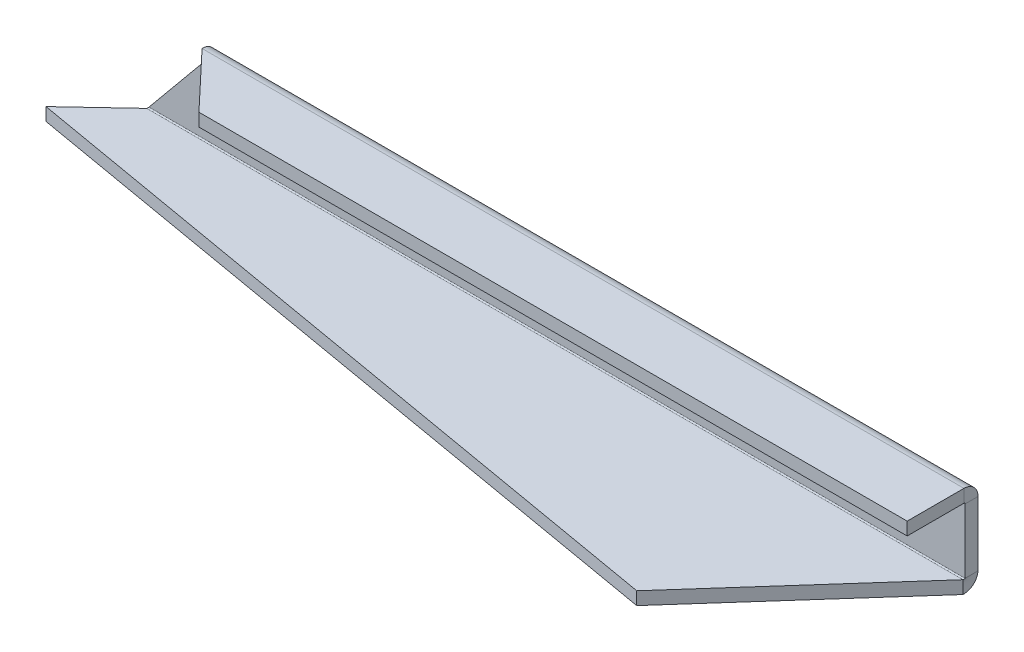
ISO-10303-21;
HEADER;
FILE_DESCRIPTION(('STEP AP214'),'2;1');
FILE_NAME('part.step','',(''),(''),'','','');
FILE_SCHEMA(('AUTOMOTIVE_DESIGN { 1 0 10303 214 1 1 1 1 }'));
ENDSEC;
DATA;
#1=APPLICATION_CONTEXT('core data for automotive mechanical design processes');
#2=APPLICATION_PROTOCOL_DEFINITION('international standard','automotive_design',2000,#1);
#3=PRODUCT_CONTEXT('',#1,'mechanical');
#4=PRODUCT('Part','Part','',(#3));
#5=PRODUCT_RELATED_PRODUCT_CATEGORY('part','',(#4));
#6=PRODUCT_DEFINITION_FORMATION('','',#4);
#7=PRODUCT_DEFINITION_CONTEXT('part definition',#1,'design');
#8=PRODUCT_DEFINITION('design','',#6,#7);
#9=PRODUCT_DEFINITION_SHAPE('','',#8);
#10=(LENGTH_UNIT() NAMED_UNIT(*) SI_UNIT(.MILLI.,.METRE.));
#11=(NAMED_UNIT(*) PLANE_ANGLE_UNIT() SI_UNIT($,.RADIAN.));
#12=(NAMED_UNIT(*) SI_UNIT($,.STERADIAN.) SOLID_ANGLE_UNIT());
#13=UNCERTAINTY_MEASURE_WITH_UNIT(LENGTH_MEASURE(1.E-05),#10,'distance_accuracy_value','');
#14=(GEOMETRIC_REPRESENTATION_CONTEXT(3) GLOBAL_UNCERTAINTY_ASSIGNED_CONTEXT((#13)) GLOBAL_UNIT_ASSIGNED_CONTEXT((#10,
#11,#12)) REPRESENTATION_CONTEXT('',''));
#15=CARTESIAN_POINT('',(0.,0.,0.));
#16=DIRECTION('',(0.,0.,1.));
#17=DIRECTION('',(1.,0.,0.));
#18=AXIS2_PLACEMENT_3D('',#15,#16,#17);
#19=CARTESIAN_POINT('',(-474.,39.9999999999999,8.));
#20=DIRECTION('',(0.771373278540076,-0.636382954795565,0.));
#21=DIRECTION('',(0.636382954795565,0.771373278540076,0.));
#22=AXIS2_PLACEMENT_3D('',#19,#20,#21);
#23=PLANE('',#22);
#24=DIRECTION('',(-0.636382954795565,-0.771373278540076,0.));
#25=VECTOR('',#24,1.);
#26=CARTESIAN_POINT('',(-474.,39.9999999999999,0.));
#27=LINE('',#26,#25);
#28=CARTESIAN_POINT('',(-474.,39.9999999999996,2.60208521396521E-13));
#29=VERTEX_POINT('',#28);
#30=CARTESIAN_POINT('',(-507.,0.,0.));
#31=VERTEX_POINT('',#30);
#32=EDGE_CURVE('E301',#29,#31,#27,.T.);
#33=ORIENTED_EDGE('',*,*,#32,.T.);
#34=DIRECTION('',(0.,0.,-1.));
#35=VECTOR('',#34,1.);
#36=CARTESIAN_POINT('',(-507.,0.,8.));
#37=LINE('',#36,#35);
#38=CARTESIAN_POINT('',(-507.,0.,8.));
#39=VERTEX_POINT('',#38);
#40=EDGE_CURVE('E13',#39,#31,#37,.T.);
#41=ORIENTED_EDGE('',*,*,#40,.F.);
#42=DIRECTION('',(-0.636382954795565,-0.771373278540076,0.));
#43=VECTOR('',#42,1.);
#44=CARTESIAN_POINT('',(-474.,39.9999999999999,8.));
#45=LINE('',#44,#43);
#46=CARTESIAN_POINT('',(-474.,39.9999999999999,8.));
#47=VERTEX_POINT('',#46);
#48=EDGE_CURVE('E345',#47,#39,#45,.T.);
#49=ORIENTED_EDGE('',*,*,#48,.F.);
#50=DIRECTION('',(0.,0.,-1.));
#51=VECTOR('',#50,1.);
#52=CARTESIAN_POINT('',(-474.,39.9999999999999,8.));
#53=LINE('',#52,#51);
#54=EDGE_CURVE('E353',#47,#29,#53,.T.);
#55=ORIENTED_EDGE('',*,*,#54,.T.);
#56=EDGE_LOOP('',(#33,#41,#49,#55));
#57=FACE_BOUND('',#56,.T.);
#58=ADVANCED_FACE('F71',(#57),#23,.F.);
#59=CARTESIAN_POINT('',(0.,0.,8.));
#60=DIRECTION('',(-1.,0.,0.));
#61=DIRECTION('',(0.,0.,1.));
#62=AXIS2_PLACEMENT_3D('',#59,#60,#61);
#63=PLANE('',#62);
#64=DIRECTION('',(0.,1.,0.));
#65=VECTOR('',#64,1.);
#66=CARTESIAN_POINT('',(0.,0.,0.));
#67=LINE('',#66,#65);
#68=CARTESIAN_POINT('',(0.,-2.03456704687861E-13,0.));
#69=VERTEX_POINT('',#68);
#70=CARTESIAN_POINT('',(0.,40.,0.));
#71=VERTEX_POINT('',#70);
#72=EDGE_CURVE('E330',#69,#71,#67,.T.);
#73=ORIENTED_EDGE('',*,*,#72,.T.);
#74=DIRECTION('',(0.,0.,-1.));
#75=VECTOR('',#74,1.);
#76=CARTESIAN_POINT('',(0.,40.,8.));
#77=LINE('',#76,#75);
#78=CARTESIAN_POINT('',(0.,40.,8.));
#79=VERTEX_POINT('',#78);
#80=EDGE_CURVE('E333',#79,#71,#77,.T.);
#81=ORIENTED_EDGE('',*,*,#80,.F.);
#82=DIRECTION('',(0.,1.,0.));
#83=VECTOR('',#82,1.);
#84=CARTESIAN_POINT('',(0.,0.,8.));
#85=LINE('',#84,#83);
#86=CARTESIAN_POINT('',(0.,0.,8.));
#87=VERTEX_POINT('',#86);
#88=EDGE_CURVE('E90',#87,#79,#85,.T.);
#89=ORIENTED_EDGE('',*,*,#88,.F.);
#90=DIRECTION('',(0.,0.,-1.));
#91=VECTOR('',#90,1.);
#92=CARTESIAN_POINT('',(0.,0.,8.));
#93=LINE('',#92,#91);
#94=EDGE_CURVE('E78',#87,#69,#93,.T.);
#95=ORIENTED_EDGE('',*,*,#94,.T.);
#96=EDGE_LOOP('',(#73,#81,#89,#95));
#97=FACE_BOUND('',#96,.T.);
#98=ADVANCED_FACE('F322',(#97),#63,.F.);
#99=CARTESIAN_POINT('',(-507.,0.,8.));
#100=DIRECTION('',(0.,0.,1.));
#101=DIRECTION('',(1.,0.,0.));
#102=AXIS2_PLACEMENT_3D('',#99,#100,#101);
#103=PLANE('',#102);
#104=ORIENTED_EDGE('',*,*,#48,.T.);
#105=DIRECTION('',(1.,0.,0.));
#106=VECTOR('',#105,1.);
#107=CARTESIAN_POINT('',(-507.,0.,8.));
#108=LINE('',#107,#106);
#109=EDGE_CURVE('E396',#39,#87,#108,.T.);
#110=ORIENTED_EDGE('',*,*,#109,.T.);
#111=ORIENTED_EDGE('',*,*,#88,.T.);
#112=DIRECTION('',(-1.,0.,0.));
#113=VECTOR('',#112,1.);
#114=CARTESIAN_POINT('',(0.,40.,8.));
#115=LINE('',#114,#113);
#116=EDGE_CURVE('E85',#79,#47,#115,.T.);
#117=ORIENTED_EDGE('',*,*,#116,.T.);
#118=EDGE_LOOP('',(#104,#110,#111,#117));
#119=FACE_BOUND('',#118,.T.);
#120=ADVANCED_FACE('F319',(#119),#103,.T.);
#121=CARTESIAN_POINT('',(-507.,0.,0.));
#122=DIRECTION('',(0.,0.,1.));
#123=DIRECTION('',(1.,0.,0.));
#124=AXIS2_PLACEMENT_3D('',#121,#122,#123);
#125=PLANE('',#124);
#126=ORIENTED_EDGE('',*,*,#32,.F.);
#127=DIRECTION('',(-1.,0.,0.));
#128=VECTOR('',#127,1.);
#129=CARTESIAN_POINT('',(0.,40.,0.));
#130=LINE('',#129,#128);
#131=EDGE_CURVE('E336',#71,#29,#130,.T.);
#132=ORIENTED_EDGE('',*,*,#131,.F.);
#133=ORIENTED_EDGE('',*,*,#72,.F.);
#134=DIRECTION('',(1.,0.,0.));
#135=VECTOR('',#134,1.);
#136=CARTESIAN_POINT('',(-507.,0.,0.));
#137=LINE('',#136,#135);
#138=EDGE_CURVE('E337',#31,#69,#137,.T.);
#139=ORIENTED_EDGE('',*,*,#138,.F.);
#140=EDGE_LOOP('',(#126,#132,#133,#139));
#141=FACE_BOUND('',#140,.T.);
#142=ADVANCED_FACE('F310',(#141),#125,.F.);
#143=CARTESIAN_POINT('',(0.,40.,8.73659999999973));
#144=DIRECTION('',(1.,0.,0.));
#145=DIRECTION('',(0.,0.,-1.));
#146=AXIS2_PLACEMENT_3D('',#143,#144,#145);
#147=PLANE('',#146);
#148=DIRECTION('',(0.,-1.,0.));
#149=VECTOR('',#148,1.);
#150=CARTESIAN_POINT('',(0.,48.7366,8.73659999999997));
#151=LINE('',#150,#149);
#152=CARTESIAN_POINT('',(0.,40.7366,8.73659999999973));
#153=VERTEX_POINT('',#152);
#154=CARTESIAN_POINT('',(0.,48.7366,8.73659999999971));
#155=VERTEX_POINT('',#154);
#156=EDGE_CURVE('E207',#153,#155,#151,.F.);
#157=ORIENTED_EDGE('',*,*,#156,.F.);
#158=CARTESIAN_POINT('',(0.,40.,8.73659999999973));
#159=DIRECTION('',(-1.,0.,0.));
#160=DIRECTION('',(0.,0.,1.));
#161=AXIS2_PLACEMENT_3D('',#158,#159,#160);
#162=CIRCLE('',#161,0.736600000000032);
#163=EDGE_CURVE('E295',#79,#153,#162,.F.);
#164=ORIENTED_EDGE('',*,*,#163,.F.);
#165=ORIENTED_EDGE('',*,*,#80,.T.);
#166=CARTESIAN_POINT('',(0.,40.,8.73659999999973));
#167=DIRECTION('',(-1.,0.,0.));
#168=DIRECTION('',(0.,0.,1.));
#169=AXIS2_PLACEMENT_3D('',#166,#167,#168);
#170=CIRCLE('',#169,8.73660000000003);
#171=EDGE_CURVE('E350',#71,#155,#170,.F.);
#172=ORIENTED_EDGE('',*,*,#171,.T.);
#173=EDGE_LOOP('',(#157,#164,#165,#172));
#174=FACE_BOUND('',#173,.T.);
#175=ADVANCED_FACE('F308',(#174),#147,.T.);
#176=CARTESIAN_POINT('',(-473.304322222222,48.8166,8.73659999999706));
#177=CARTESIAN_POINT('',(-473.362305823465,48.8165999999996,7.58230216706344));
#178=CARTESIAN_POINT('',(-473.420268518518,48.5871275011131,6.4288736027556));
#179=CARTESIAN_POINT('',(-473.536214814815,47.703825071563,4.29639289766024));
#180=CARTESIAN_POINT('',(-473.594187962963,47.0503426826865,3.31838738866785));
#181=CARTESIAN_POINT('',(-473.710134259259,45.4182126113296,1.68625731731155));
#182=CARTESIAN_POINT('',(-473.768107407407,44.4402071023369,1.0327749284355));
#183=CARTESIAN_POINT('',(-473.884053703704,42.3077263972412,0.149472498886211));
#184=CARTESIAN_POINT('',(-473.942016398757,41.1542978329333,-0.0799999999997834));
#185=CARTESIAN_POINT('',(-474.,39.9999999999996,-0.0799999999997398));
#186=CARTESIAN_POINT('',(-473.304322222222,48.7366,8.73659999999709));
#187=CARTESIAN_POINT('',(-473.36230579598,48.7365999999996,7.59277607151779));
#188=CARTESIAN_POINT('',(-473.420268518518,48.5092096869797,6.44981343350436));
#189=CARTESIAN_POINT('',(-473.536214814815,47.6339221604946,4.33668241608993));
#190=CARTESIAN_POINT('',(-473.594187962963,46.9863693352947,3.36755112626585));
#191=CARTESIAN_POINT('',(-473.710134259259,45.3690488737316,1.75023066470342));
#192=CARTESIAN_POINT('',(-473.768107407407,44.3999175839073,1.10267783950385));
#193=CARTESIAN_POINT('',(-473.884053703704,42.2867865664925,0.227390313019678));
#194=CARTESIAN_POINT('',(-473.942016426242,41.1438239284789,2.17047683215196E-13));
#195=CARTESIAN_POINT('',(-474.,39.9999999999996,2.60208521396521E-13));
#196=CARTESIAN_POINT('',(-473.304322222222,40.7366,8.73660000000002));
#197=CARTESIAN_POINT('',(-473.362303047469,40.7366,8.64016651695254));
#198=CARTESIAN_POINT('',(-473.420268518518,40.7174282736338,8.54379650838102));
#199=CARTESIAN_POINT('',(-473.536214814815,40.6436310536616,8.36563425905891));
#200=CARTESIAN_POINT('',(-473.594187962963,40.5890345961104,8.28392488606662));
#201=CARTESIAN_POINT('',(-473.710134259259,40.4526751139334,8.14756540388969));
#202=CARTESIAN_POINT('',(-473.768107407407,40.3709657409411,8.09296894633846));
#203=CARTESIAN_POINT('',(-473.884053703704,40.192803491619,8.01917172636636));
#204=CARTESIAN_POINT('',(-473.942019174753,40.0964334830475,8.00000000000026));
#205=CARTESIAN_POINT('',(-474.,39.9999999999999,8.00000000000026));
#206=CARTESIAN_POINT('',(-473.304322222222,40.6558,8.73660000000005));
#207=CARTESIAN_POINT('',(-473.362303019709,40.6558,8.65074516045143));
#208=CARTESIAN_POINT('',(-473.420268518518,40.638731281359,8.56494573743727));
#209=CARTESIAN_POINT('',(-473.536214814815,40.5730291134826,8.4063266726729));
#210=CARTESIAN_POINT('',(-473.594187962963,40.5244215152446,8.3335802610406));
#211=CARTESIAN_POINT('',(-473.710134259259,40.4030197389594,8.21217848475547));
#212=CARTESIAN_POINT('',(-473.768107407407,40.3302733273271,8.1635708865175));
#213=CARTESIAN_POINT('',(-473.884053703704,40.1716542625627,8.09786871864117));
#214=CARTESIAN_POINT('',(-473.942019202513,40.0858548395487,8.08080000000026));
#215=CARTESIAN_POINT('',(-474.,39.9999999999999,8.08080000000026));
#216=B_SPLINE_SURFACE_WITH_KNOTS('',1,3,((#176,#177,#178,#179,#180,#181,#182,#183,#184,#185),
(#186,#187,#188,#189,#190,#191,#192,#193,#194,#195),(#196,#197,#198,#199,#200,#201,#202,#203,
#204,#205),(#206,#207,#208,#209,#210,#211,#212,#213,#214,#215)),.UNSPECIFIED.,.F.,.F.,.F.,(2,1,
1,2),(4,2,2,2,4),(-0.01,0.,1.,1.0101),(0.,0.25,0.5,0.75,1.),.UNSPECIFIED.);
#217=CARTESIAN_POINT('',(-473.304322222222,40.7366,8.73660000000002));
#218=CARTESIAN_POINT('',(-473.320538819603,40.73660058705,8.7096318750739));
#219=CARTESIAN_POINT('',(-473.336743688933,40.7351175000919,8.68268000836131));
#220=CARTESIAN_POINT('',(-473.369152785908,40.7292122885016,8.62909970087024));
#221=CARTESIAN_POINT('',(-473.38535701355,40.72479015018,8.60247126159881));
#222=CARTESIAN_POINT('',(-473.433904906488,40.7071931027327,8.52366662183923));
#223=CARTESIAN_POINT('',(-473.466281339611,40.6896871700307,8.4724049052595));
#224=CARTESIAN_POINT('',(-473.52775451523,40.6462641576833,8.37984444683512));
#225=CARTESIAN_POINT('',(-473.55685520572,40.6213642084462,8.33806204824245));
#226=CARTESIAN_POINT('',(-473.615048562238,40.5638769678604,8.26019703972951));
#227=CARTESIAN_POINT('',(-473.644141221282,40.531294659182,8.22411076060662));
#228=CARTESIAN_POINT('',(-473.702317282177,40.4597020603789,8.1590233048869));
#229=CARTESIAN_POINT('',(-473.73140068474,40.4206926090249,8.13002120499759));
#230=CARTESIAN_POINT('',(-473.789584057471,40.3377317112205,8.08020183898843));
#231=CARTESIAN_POINT('',(-473.818684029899,40.2937785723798,8.05938738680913));
#232=CARTESIAN_POINT('',(-473.873157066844,40.2084796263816,8.02886005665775));
#233=CARTESIAN_POINT('',(-473.898532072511,40.1675163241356,8.01806980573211));
#234=CARTESIAN_POINT('',(-473.949269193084,40.0843743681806,8.00362431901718));
#235=CARTESIAN_POINT('',(-473.97463130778,40.0421963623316,7.99996534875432));
#236=CARTESIAN_POINT('',(-474.,39.9999999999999,8.00000000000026));
#237=B_SPLINE_CURVE_WITH_KNOTS('',3,(#217,#218,#219,#220,#221,#222,#223,#224,#225,#226,#227,
#228,#229,#230,#231,#232,#233,#234,#235,#236),.UNSPECIFIED.,.F.,.F.,(4,2,2,2,2,2,2,2,2,4),(0.,
0.0943306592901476,0.188661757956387,0.37675487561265,0.546023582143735,0.715182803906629,
0.884319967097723,1.05351520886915,1.20112966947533,1.34866680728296),.UNSPECIFIED.);
#238=CARTESIAN_POINT('',(-473.304322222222,40.7366,8.73660000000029));
#239=VERTEX_POINT('',#238);
#240=EDGE_CURVE('E287',#239,#47,#237,.T.);
#241=DIRECTION('',(0.,-1.,0.));
#242=VECTOR('',#241,1.);
#243=CARTESIAN_POINT('',(-473.304322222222,40.7365999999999,8.73660000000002));
#244=LINE('',#243,#242);
#245=CARTESIAN_POINT('',(-473.304322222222,48.7365999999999,8.73659999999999));
#246=VERTEX_POINT('',#245);
#247=EDGE_CURVE('E362',#239,#246,#244,.F.);
#248=CARTESIAN_POINT('',(-473.304322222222,48.7366,8.73659999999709));
#249=CARTESIAN_POINT('',(-473.316795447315,48.7366265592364,8.4905540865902));
#250=CARTESIAN_POINT('',(-473.329268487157,48.726207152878,8.24451198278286));
#251=CARTESIAN_POINT('',(-473.354213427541,48.6846682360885,7.75419269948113));
#252=CARTESIAN_POINT('',(-473.366685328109,48.6535497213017,7.50991543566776));
#253=CARTESIAN_POINT('',(-473.391618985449,48.5708356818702,7.02504262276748));
#254=CARTESIAN_POINT('',(-473.404080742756,48.5192556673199,6.78444442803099));
#255=CARTESIAN_POINT('',(-473.429005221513,48.3959948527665,6.30845671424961));
#256=CARTESIAN_POINT('',(-473.44146794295,48.324314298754,6.07306713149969));
#257=CARTESIAN_POINT('',(-473.466399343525,48.1613213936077,5.60905921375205));
#258=CARTESIAN_POINT('',(-473.478868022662,48.0699996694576,5.38044417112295));
#259=CARTESIAN_POINT('',(-473.5038059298,47.8683941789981,4.93172798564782));
#260=CARTESIAN_POINT('',(-473.516275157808,47.7581100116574,4.71162702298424));
#261=CARTESIAN_POINT('',(-473.541210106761,47.5193892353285,4.28155322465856));
#262=CARTESIAN_POINT('',(-473.553675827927,47.3909560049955,4.07157851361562));
#263=CARTESIAN_POINT('',(-473.578607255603,47.116837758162,3.66321102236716));
#264=CARTESIAN_POINT('',(-473.591072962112,46.9711528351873,3.46481817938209));
#265=CARTESIAN_POINT('',(-473.616005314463,46.6635715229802,3.08103036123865));
#266=CARTESIAN_POINT('',(-473.628471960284,46.501675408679,2.89563516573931));
#267=CARTESIAN_POINT('',(-473.653404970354,46.1628233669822,2.53916008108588));
#268=CARTESIAN_POINT('',(-473.665871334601,45.9858674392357,2.36808019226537));
#269=CARTESIAN_POINT('',(-473.690806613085,45.6181184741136,2.04142089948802));
#270=CARTESIAN_POINT('',(-473.703275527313,45.4273225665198,1.88584472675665));
#271=CARTESIAN_POINT('',(-473.728212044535,45.0332897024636,1.59134479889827));
#272=CARTESIAN_POINT('',(-473.740679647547,44.8300529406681,1.45242078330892));
#273=CARTESIAN_POINT('',(-473.765618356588,44.4125383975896,1.19218442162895));
#274=CARTESIAN_POINT('',(-473.778089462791,44.1982582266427,1.07087590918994));
#275=CARTESIAN_POINT('',(-473.803031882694,43.7602324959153,0.846773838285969));
#276=CARTESIAN_POINT('',(-473.815503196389,43.5364870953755,0.743979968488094));
#277=CARTESIAN_POINT('',(-473.840440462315,43.0812193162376,0.557680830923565));
#278=CARTESIAN_POINT('',(-473.852906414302,42.8497006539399,0.474166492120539));
#279=CARTESIAN_POINT('',(-473.877832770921,42.3805359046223,0.326980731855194));
#280=CARTESIAN_POINT('',(-473.890293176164,42.1428913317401,0.263304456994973));
#281=CARTESIAN_POINT('',(-473.918973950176,41.5906742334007,0.140078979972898));
#282=CARTESIAN_POINT('',(-473.935196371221,41.2744908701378,0.0875499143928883));
#283=CARTESIAN_POINT('',(-473.959511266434,40.7977234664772,0.0350255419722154));
#284=CARTESIAN_POINT('',(-473.967608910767,40.6384689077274,0.0218956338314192));
#285=CARTESIAN_POINT('',(-473.983803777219,40.31948900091,0.00438386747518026));
#286=CARTESIAN_POINT('',(-473.991900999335,40.1597636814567,1.48811112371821E-06));
#287=CARTESIAN_POINT('',(-474.,39.9999999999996,2.60208521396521E-13));
#288=B_SPLINE_CURVE_WITH_KNOTS('',3,(#248,#249,#250,#251,#252,#253,#254,#255,#256,#257,#258,
#259,#260,#261,#262,#263,#264,#265,#266,#267,#268,#269,#270,#271,#272,#273,#274,#275,#276,#277,
#278,#279,#280,#281,#282,#283,#284,#285,#286,#287),.UNSPECIFIED.,.F.,.F.,(4,2,2,2,2,2,2,2,2,2,2,
2,2,2,2,2,2,2,2,4),(0.,0.738860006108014,1.47768447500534,2.21594997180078,2.9542064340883,
3.69281598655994,4.43144116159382,5.16992901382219,5.90841286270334,6.64688418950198,
7.38535553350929,8.12398046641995,8.86259384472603,9.60136772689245,10.340129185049,
11.0785423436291,11.8167747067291,12.777367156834,13.2571655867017,13.7369354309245),.UNSPECIFIED.);
#289=EDGE_CURVE('E296',#246,#29,#288,.T.);
#290=ORIENTED_EDGE('',*,*,#240,.F.);
#291=ORIENTED_EDGE('',*,*,#247,.T.);
#292=ORIENTED_EDGE('',*,*,#289,.T.);
#293=ORIENTED_EDGE('',*,*,#54,.F.);
#294=EDGE_LOOP('',(#290,#291,#292,#293));
#295=FACE_BOUND('',#294,.T.);
#296=ADVANCED_FACE('F283',(#295),#216,.F.);
#297=CARTESIAN_POINT('',(-474.,40.,8.73660000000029));
#298=DIRECTION('',(-1.,0.,0.));
#299=DIRECTION('',(0.,1.,0.));
#300=AXIS2_PLACEMENT_3D('',#297,#298,#299);
#301=CYLINDRICAL_SURFACE('',#300,8.73660000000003);
#302=ORIENTED_EDGE('',*,*,#131,.T.);
#303=ORIENTED_EDGE('',*,*,#289,.F.);
#304=DIRECTION('',(-1.,0.,0.));
#305=VECTOR('',#304,1.);
#306=CARTESIAN_POINT('',(0.,48.7366,8.73659999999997));
#307=LINE('',#306,#305);
#308=EDGE_CURVE('E356',#155,#246,#307,.T.);
#309=ORIENTED_EDGE('',*,*,#308,.F.);
#310=ORIENTED_EDGE('',*,*,#171,.F.);
#311=EDGE_LOOP('',(#302,#303,#309,#310));
#312=FACE_BOUND('',#311,.T.);
#313=ADVANCED_FACE('F281',(#312),#301,.T.);
#314=CARTESIAN_POINT('',(-474.,40.,8.73660000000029));
#315=DIRECTION('',(-1.,0.,0.));
#316=DIRECTION('',(0.,1.,0.));
#317=AXIS2_PLACEMENT_3D('',#314,#315,#316);
#318=CYLINDRICAL_SURFACE('',#317,0.736600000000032);
#319=ORIENTED_EDGE('',*,*,#116,.F.);
#320=ORIENTED_EDGE('',*,*,#163,.T.);
#321=DIRECTION('',(1.,0.,0.));
#322=VECTOR('',#321,1.);
#323=CARTESIAN_POINT('',(0.,40.7366,8.7366));
#324=LINE('',#323,#322);
#325=EDGE_CURVE('E360',#153,#239,#324,.F.);
#326=ORIENTED_EDGE('',*,*,#325,.T.);
#327=ORIENTED_EDGE('',*,*,#240,.T.);
#328=EDGE_LOOP('',(#319,#320,#326,#327));
#329=FACE_BOUND('',#328,.T.);
#330=ADVANCED_FACE('F276',(#329),#318,.F.);
#331=CARTESIAN_POINT('',(-440.,48.7366000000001,44.));
#332=DIRECTION('',(0.727013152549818,0.,-0.686623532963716));
#333=DIRECTION('',(-0.686623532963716,0.,-0.727013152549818));
#334=AXIS2_PLACEMENT_3D('',#331,#332,#333);
#335=PLANE('',#334);
#336=ORIENTED_EDGE('',*,*,#247,.F.);
#337=DIRECTION('',(0.686623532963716,0.,0.727013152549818));
#338=VECTOR('',#337,1.);
#339=CARTESIAN_POINT('',(-440.,40.7366000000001,44.));
#340=LINE('',#339,#338);
#341=CARTESIAN_POINT('',(-440.,40.7366000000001,44.));
#342=VERTEX_POINT('',#341);
#343=EDGE_CURVE('E366',#239,#342,#340,.T.);
#344=ORIENTED_EDGE('',*,*,#343,.T.);
#345=DIRECTION('',(0.,-1.,0.));
#346=VECTOR('',#345,1.);
#347=CARTESIAN_POINT('',(-440.,48.7366000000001,44.));
#348=LINE('',#347,#346);
#349=CARTESIAN_POINT('',(-440.,48.7366000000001,44.));
#350=VERTEX_POINT('',#349);
#351=EDGE_CURVE('E243',#350,#342,#348,.T.);
#352=ORIENTED_EDGE('',*,*,#351,.F.);
#353=DIRECTION('',(-0.686623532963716,0.,-0.727013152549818));
#354=VECTOR('',#353,1.);
#355=CARTESIAN_POINT('',(-250.531810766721,48.7366000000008,244.613376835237));
#356=LINE('',#355,#354);
#357=EDGE_CURVE('E373',#246,#350,#356,.F.);
#358=ORIENTED_EDGE('',*,*,#357,.F.);
#359=EDGE_LOOP('',(#336,#344,#352,#358));
#360=FACE_BOUND('',#359,.T.);
#361=ADVANCED_FACE('F269',(#360),#335,.F.);
#362=CARTESIAN_POINT('',(0.,48.7366,7.99999999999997));
#363=DIRECTION('',(-1.,0.,0.));
#364=DIRECTION('',(0.,-1.,0.));
#365=AXIS2_PLACEMENT_3D('',#362,#363,#364);
#366=PLANE('',#365);
#367=ORIENTED_EDGE('',*,*,#156,.T.);
#368=DIRECTION('',(0.,0.,1.));
#369=VECTOR('',#368,1.);
#370=CARTESIAN_POINT('',(0.,48.7366,7.99999999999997));
#371=LINE('',#370,#369);
#372=CARTESIAN_POINT('',(0.,48.7366000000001,44.));
#373=VERTEX_POINT('',#372);
#374=EDGE_CURVE('E377',#373,#155,#371,.F.);
#375=ORIENTED_EDGE('',*,*,#374,.F.);
#376=DIRECTION('',(0.,-1.,0.));
#377=VECTOR('',#376,1.);
#378=CARTESIAN_POINT('',(0.,48.7366000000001,44.));
#379=LINE('',#378,#377);
#380=CARTESIAN_POINT('',(0.,40.7366000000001,44.));
#381=VERTEX_POINT('',#380);
#382=EDGE_CURVE('E379',#373,#381,#379,.T.);
#383=ORIENTED_EDGE('',*,*,#382,.T.);
#384=DIRECTION('',(0.,0.,-1.));
#385=VECTOR('',#384,1.);
#386=CARTESIAN_POINT('',(0.,40.7366,8.));
#387=LINE('',#386,#385);
#388=EDGE_CURVE('E370',#381,#153,#387,.T.);
#389=ORIENTED_EDGE('',*,*,#388,.T.);
#390=EDGE_LOOP('',(#367,#375,#383,#389));
#391=FACE_BOUND('',#390,.T.);
#392=ADVANCED_FACE('F265',(#391),#366,.F.);
#393=CARTESIAN_POINT('',(0.,48.7366,7.99999999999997));
#394=DIRECTION('',(0.,1.,0.));
#395=DIRECTION('',(0.,0.,1.));
#396=AXIS2_PLACEMENT_3D('',#393,#394,#395);
#397=PLANE('',#396);
#398=ORIENTED_EDGE('',*,*,#374,.T.);
#399=ORIENTED_EDGE('',*,*,#308,.T.);
#400=ORIENTED_EDGE('',*,*,#357,.T.);
#401=DIRECTION('',(-1.,0.,0.));
#402=VECTOR('',#401,1.);
#403=CARTESIAN_POINT('',(0.,48.7366000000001,44.));
#404=LINE('',#403,#402);
#405=EDGE_CURVE('E375',#350,#373,#404,.F.);
#406=ORIENTED_EDGE('',*,*,#405,.T.);
#407=EDGE_LOOP('',(#398,#399,#400,#406));
#408=FACE_BOUND('',#407,.T.);
#409=ADVANCED_FACE('F261',(#408),#397,.T.);
#410=CARTESIAN_POINT('',(0.,40.7366,8.));
#411=DIRECTION('',(0.,1.,0.));
#412=DIRECTION('',(0.,0.,1.));
#413=AXIS2_PLACEMENT_3D('',#410,#411,#412);
#414=PLANE('',#413);
#415=ORIENTED_EDGE('',*,*,#325,.F.);
#416=ORIENTED_EDGE('',*,*,#388,.F.);
#417=DIRECTION('',(1.,0.,0.));
#418=VECTOR('',#417,1.);
#419=CARTESIAN_POINT('',(0.,40.7366000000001,44.));
#420=LINE('',#419,#418);
#421=EDGE_CURVE('E368',#342,#381,#420,.T.);
#422=ORIENTED_EDGE('',*,*,#421,.F.);
#423=ORIENTED_EDGE('',*,*,#343,.F.);
#424=EDGE_LOOP('',(#415,#416,#422,#423));
#425=FACE_BOUND('',#424,.T.);
#426=ADVANCED_FACE('F251',(#425),#414,.F.);
#427=CARTESIAN_POINT('',(0.,48.7366000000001,44.));
#428=DIRECTION('',(0.,0.,-1.));
#429=DIRECTION('',(0.,1.,0.));
#430=AXIS2_PLACEMENT_3D('',#427,#428,#429);
#431=PLANE('',#430);
#432=ORIENTED_EDGE('',*,*,#421,.T.);
#433=ORIENTED_EDGE('',*,*,#382,.F.);
#434=ORIENTED_EDGE('',*,*,#405,.F.);
#435=ORIENTED_EDGE('',*,*,#351,.T.);
#436=EDGE_LOOP('',(#432,#433,#434,#435));
#437=FACE_BOUND('',#436,.T.);
#438=ADVANCED_FACE('F260',(#437),#431,.F.);
#439=CARTESIAN_POINT('',(-507.,2.03546454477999E-13,-0.0799999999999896));
#440=CARTESIAN_POINT('',(-507.065355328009,-1.15429769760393,-0.0800000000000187));
#441=CARTESIAN_POINT('',(-507.130687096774,-2.30772639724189,0.149472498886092));
#442=CARTESIAN_POINT('',(-507.261374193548,-4.44020710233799,1.0327749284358));
#443=CARTESIAN_POINT('',(-507.326717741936,-5.41821261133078,1.68625731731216));
#444=CARTESIAN_POINT('',(-507.45740483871,-7.05034268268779,3.31838738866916));
#445=CARTESIAN_POINT('',(-507.522748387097,-7.70382507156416,4.29639289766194));
#446=CARTESIAN_POINT('',(-507.653435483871,-8.58712750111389,6.42887360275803));
#447=CARTESIAN_POINT('',(-507.718767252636,-8.81660000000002,7.58230230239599));
#448=CARTESIAN_POINT('',(-507.784122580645,-8.8166,8.73660000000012));
#449=CARTESIAN_POINT('',(-507.,2.01531204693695E-13,0.));
#450=CARTESIAN_POINT('',(-507.065355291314,-1.14382378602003,0.));
#451=CARTESIAN_POINT('',(-507.130687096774,-2.28678656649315,0.227390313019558));
#452=CARTESIAN_POINT('',(-507.261374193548,-4.39991758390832,1.10267783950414));
#453=CARTESIAN_POINT('',(-507.326717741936,-5.36904887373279,1.75023066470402));
#454=CARTESIAN_POINT('',(-507.45740483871,-6.98636933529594,3.36755112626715));
#455=CARTESIAN_POINT('',(-507.522748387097,-7.63392216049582,4.33668241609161));
#456=CARTESIAN_POINT('',(-507.653435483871,-8.50920968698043,6.44981343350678));
#457=CARTESIAN_POINT('',(-507.718767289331,-8.73660000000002,7.59277621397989));
#458=CARTESIAN_POINT('',(-507.784122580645,-8.7366,8.73660000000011));
#459=CARTESIAN_POINT('',(-507.,0.,8.00000000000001));
#460=CARTESIAN_POINT('',(-507.065351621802,-0.0964326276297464,8.00000000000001));
#461=CARTESIAN_POINT('',(-507.130687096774,-0.192803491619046,8.01917172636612));
#462=CARTESIAN_POINT('',(-507.261374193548,-0.370965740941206,8.09296894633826));
#463=CARTESIAN_POINT('',(-507.326717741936,-0.452675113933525,8.1475654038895));
#464=CARTESIAN_POINT('',(-507.45740483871,-0.589034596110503,8.28392488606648));
#465=CARTESIAN_POINT('',(-507.522748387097,-0.64363105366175,8.3656342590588));
#466=CARTESIAN_POINT('',(-507.653435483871,-0.717428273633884,8.54379650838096));
#467=CARTESIAN_POINT('',(-507.718770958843,-0.736600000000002,8.64016737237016));
#468=CARTESIAN_POINT('',(-507.784122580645,-0.736600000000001,8.7366));
#469=CARTESIAN_POINT('',(-507.,0.,8.08080000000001));
#470=CARTESIAN_POINT('',(-507.06535158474,-0.0858539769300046,8.08080000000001));
#471=CARTESIAN_POINT('',(-507.130687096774,-0.171654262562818,8.09786871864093));
#472=CARTESIAN_POINT('',(-507.261374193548,-0.330273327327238,8.16357088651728));
#473=CARTESIAN_POINT('',(-507.326717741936,-0.403019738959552,8.21217848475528));
#474=CARTESIAN_POINT('',(-507.45740483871,-0.52442151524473,8.33358026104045));
#475=CARTESIAN_POINT('',(-507.522748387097,-0.573029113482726,8.40632667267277));
#476=CARTESIAN_POINT('',(-507.653435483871,-0.638731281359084,8.56494573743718));
#477=CARTESIAN_POINT('',(-507.718770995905,-0.655800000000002,8.6507460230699));
#478=CARTESIAN_POINT('',(-507.784122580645,-0.6558,8.7366));
#479=B_SPLINE_SURFACE_WITH_KNOTS('',1,3,((#439,#440,#441,#442,#443,#444,#445,#446,#447,#448),
(#449,#450,#451,#452,#453,#454,#455,#456,#457,#458),(#459,#460,#461,#462,#463,#464,#465,#466,
#467,#468),(#469,#470,#471,#472,#473,#474,#475,#476,#477,#478)),.UNSPECIFIED.,.F.,.F.,.F.,(2,1,
1,2),(4,2,2,2,4),(-0.01,0.,1.,1.0101),(0.,0.25,0.5,0.75,1.),.UNSPECIFIED.);
#480=DIRECTION('',(0.,1.,0.));
#481=VECTOR('',#480,1.);
#482=CARTESIAN_POINT('',(-507.784122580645,-8.7366,8.73659999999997));
#483=LINE('',#482,#481);
#484=CARTESIAN_POINT('',(-507.784122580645,-0.736600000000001,8.73659999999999));
#485=VERTEX_POINT('',#484);
#486=CARTESIAN_POINT('',(-507.784122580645,-8.7366,8.73659999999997));
#487=VERTEX_POINT('',#486);
#488=EDGE_CURVE('E182',#485,#487,#483,.F.);
#489=CARTESIAN_POINT('',(-507.,0.,8.00000000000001));
#490=CARTESIAN_POINT('',(-507.017591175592,-0.0259546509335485,7.99999898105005));
#491=CARTESIAN_POINT('',(-507.035171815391,-0.051896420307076,8.00137291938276));
#492=CARTESIAN_POINT('',(-507.07033152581,-0.10349024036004,8.00684475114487));
#493=CARTESIAN_POINT('',(-507.087910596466,-0.12914230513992,8.0109425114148));
#494=CARTESIAN_POINT('',(-507.140603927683,-0.20516603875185,8.02726007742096));
#495=CARTESIAN_POINT('',(-507.17574749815,-0.254715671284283,8.04350440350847));
#496=CARTESIAN_POINT('',(-507.244852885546,-0.347724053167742,8.08530458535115));
#497=CARTESIAN_POINT('',(-507.278815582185,-0.391329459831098,8.11053687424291));
#498=CARTESIAN_POINT('',(-507.346732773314,-0.472507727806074,8.16930502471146));
#499=CARTESIAN_POINT('',(-507.380687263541,-0.510083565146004,8.20283676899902));
#500=CARTESIAN_POINT('',(-507.44859217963,-0.577660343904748,8.27681835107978));
#501=CARTESIAN_POINT('',(-507.482542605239,-0.60766094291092,8.3172685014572));
#502=CARTESIAN_POINT('',(-507.55045958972,-0.658851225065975,8.40342557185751));
#503=CARTESIAN_POINT('',(-507.584426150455,-0.680039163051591,8.44913353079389));
#504=CARTESIAN_POINT('',(-507.646020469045,-0.709663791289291,8.53505631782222));
#505=CARTESIAN_POINT('',(-507.673652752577,-0.719738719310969,8.5747126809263));
#506=CARTESIAN_POINT('',(-507.728894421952,-0.733218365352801,8.65510709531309));
#507=CARTESIAN_POINT('',(-507.756503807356,-0.736628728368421,8.69584420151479));
#508=CARTESIAN_POINT('',(-507.784122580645,-0.736600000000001,8.7366));
#509=B_SPLINE_CURVE_WITH_KNOTS('',3,(#489,#490,#491,#492,#493,#494,#495,#496,#497,#498,#499,
#500,#501,#502,#503,#504,#505,#506,#507,#508),.UNSPECIFIED.,.F.,.F.,(4,2,2,2,2,2,2,2,2,4),(0.,
0.0940000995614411,0.187995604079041,0.375594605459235,0.557028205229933,0.738371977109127,
0.919723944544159,1.10111180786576,1.24877926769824,1.39632159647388),.UNSPECIFIED.);
#510=EDGE_CURVE('E232',#39,#485,#509,.T.);
#511=CARTESIAN_POINT('',(-507.,2.01531204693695E-13,0.));
#512=CARTESIAN_POINT('',(-507.014063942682,-0.246132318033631,-2.65962012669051E-05));
#513=CARTESIAN_POINT('',(-507.028127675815,-0.492260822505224,0.0104001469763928));
#514=CARTESIAN_POINT('',(-507.056253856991,-0.982751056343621,0.0519682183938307));
#515=CARTESIAN_POINT('',(-507.070316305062,-1.22711287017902,0.0831085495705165));
#516=CARTESIAN_POINT('',(-507.098429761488,-1.71215099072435,0.165880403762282));
#517=CARTESIAN_POINT('',(-507.112480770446,-1.95282994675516,0.217496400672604));
#518=CARTESIAN_POINT('',(-507.140583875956,-2.42897371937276,0.340842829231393));
#519=CARTESIAN_POINT('',(-507.154635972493,-2.66443859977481,0.412573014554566));
#520=CARTESIAN_POINT('',(-507.182746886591,-3.12859007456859,0.575678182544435));
#521=CARTESIAN_POINT('',(-507.196805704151,-3.35727337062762,0.667062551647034));
#522=CARTESIAN_POINT('',(-507.224923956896,-3.80611725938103,0.868805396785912));
#523=CARTESIAN_POINT('',(-507.238983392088,-4.02627767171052,0.979164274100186));
#524=CARTESIAN_POINT('',(-507.26709830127,-4.45645994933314,1.21804539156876));
#525=CARTESIAN_POINT('',(-507.281153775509,-4.66648369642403,1.34656424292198));
#526=CARTESIAN_POINT('',(-507.309264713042,-5.07493754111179,1.62086344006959));
#527=CARTESIAN_POINT('',(-507.323320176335,-5.27336770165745,1.7666436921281));
#528=CARTESIAN_POINT('',(-507.351432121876,-5.65721666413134,2.07442354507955));
#529=CARTESIAN_POINT('',(-507.365488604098,-5.84263572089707,2.23642282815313));
#530=CARTESIAN_POINT('',(-507.39360125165,-6.19914453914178,2.57548788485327));
#531=CARTESIAN_POINT('',(-507.407657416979,-6.37023430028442,2.75255365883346));
#532=CARTESIAN_POINT('',(-507.435772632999,-6.69689861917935,3.12052756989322));
#533=CARTESIAN_POINT('',(-507.44983168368,-6.85246992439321,3.31143859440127));
#534=CARTESIAN_POINT('',(-507.477948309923,-7.14694442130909,3.70570496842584));
#535=CARTESIAN_POINT('',(-507.492005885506,-7.28584787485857,3.90906012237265));
#536=CARTESIAN_POINT('',(-507.520125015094,-7.54602704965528,4.32681318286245));
#537=CARTESIAN_POINT('',(-507.534186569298,-7.66729890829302,4.5412134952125));
#538=CARTESIAN_POINT('',(-507.562309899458,-7.89131102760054,4.97947903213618));
#539=CARTESIAN_POINT('',(-507.576371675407,-7.99405160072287,5.20334409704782));
#540=CARTESIAN_POINT('',(-507.604489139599,-8.18022708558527,5.65884786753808));
#541=CARTESIAN_POINT('',(-507.618544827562,-8.26367114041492,5.89048283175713));
#542=CARTESIAN_POINT('',(-507.646649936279,-8.41069976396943,6.35987568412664));
#543=CARTESIAN_POINT('',(-507.660699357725,-8.47428921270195,6.59763205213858));
#544=CARTESIAN_POINT('',(-507.692992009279,-8.59712271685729,7.14931898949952));
#545=CARTESIAN_POINT('',(-507.711237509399,-8.64942646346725,7.46483826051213));
#546=CARTESIAN_POINT('',(-507.738584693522,-8.70172519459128,7.94059194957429));
#547=CARTESIAN_POINT('',(-507.747692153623,-8.71479861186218,8.09950523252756));
#548=CARTESIAN_POINT('',(-507.76590660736,-8.73223502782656,8.41779968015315));
#549=CARTESIAN_POINT('',(-507.775013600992,-8.73659853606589,8.5771808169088));
#550=CARTESIAN_POINT('',(-507.784122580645,-8.7366,8.73660000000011));
#551=B_SPLINE_CURVE_WITH_KNOTS('',3,(#511,#512,#513,#514,#515,#516,#517,#518,#519,#520,#521,
#522,#523,#524,#525,#526,#527,#528,#529,#530,#531,#532,#533,#534,#535,#536,#537,#538,#539,#540,
#541,#542,#543,#544,#545,#546,#547,#548,#549,#550),.UNSPECIFIED.,.F.,.F.,(4,2,2,2,2,2,2,2,2,2,2,
2,2,2,2,2,2,2,2,4),(0.,0.739375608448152,1.47871562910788,2.2174960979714,2.95626751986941,
3.69539255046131,4.43453321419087,5.17353612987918,5.91253503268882,6.65151945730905,
7.3905038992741,8.12964290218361,8.8687702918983,9.60805936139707,10.3473359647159,
11.0862615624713,11.8250053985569,12.7838666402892,13.2627966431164,13.7416986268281),.UNSPECIFIED.);
#552=EDGE_CURVE('E199',#31,#487,#551,.T.);
#553=ORIENTED_EDGE('',*,*,#488,.F.);
#554=ORIENTED_EDGE('',*,*,#510,.F.);
#555=ORIENTED_EDGE('',*,*,#40,.T.);
#556=ORIENTED_EDGE('',*,*,#552,.T.);
#557=EDGE_LOOP('',(#553,#554,#555,#556));
#558=FACE_BOUND('',#557,.T.);
#559=ADVANCED_FACE('F214',(#558),#479,.F.);
#560=CARTESIAN_POINT('',(-0.654755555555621,-8.81659999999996,8.73660000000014));
#561=CARTESIAN_POINT('',(-0.600182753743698,-8.81659999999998,7.58230211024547));
#562=CARTESIAN_POINT('',(-0.545629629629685,-8.58712750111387,6.42887360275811));
#563=CARTESIAN_POINT('',(-0.436503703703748,-7.7038250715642,4.29639289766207));
#564=CARTESIAN_POINT('',(-0.381940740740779,-7.05034268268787,3.31838738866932));
#565=CARTESIAN_POINT('',(-0.272814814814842,-5.41821261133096,1.68625731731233));
#566=CARTESIAN_POINT('',(-0.218251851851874,-4.44020710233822,1.03277492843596));
#567=CARTESIAN_POINT('',(-0.109125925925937,-2.30772639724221,0.149472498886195));
#568=CARTESIAN_POINT('',(-0.054572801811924,-1.15429788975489,-0.0799999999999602));
#569=CARTESIAN_POINT('',(0.,-2.0549154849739E-13,-0.0799999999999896));
#570=CARTESIAN_POINT('',(-0.654755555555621,-8.73659999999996,8.73660000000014));
#571=CARTESIAN_POINT('',(-0.600182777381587,-8.73659999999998,7.59277601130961));
#572=CARTESIAN_POINT('',(-0.545629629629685,-8.50920968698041,6.44981343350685));
#573=CARTESIAN_POINT('',(-0.436503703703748,-7.63392216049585,4.33668241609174));
#574=CARTESIAN_POINT('',(-0.381940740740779,-6.98636933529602,3.36755112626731));
#575=CARTESIAN_POINT('',(-0.272814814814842,-5.36904887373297,1.75023066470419));
#576=CARTESIAN_POINT('',(-0.218251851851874,-4.39991758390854,1.1026778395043));
#577=CARTESIAN_POINT('',(-0.109125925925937,-2.28678656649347,0.22739031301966));
#578=CARTESIAN_POINT('',(-0.054572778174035,-1.14382398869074,0.));
#579=CARTESIAN_POINT('',(0.,-2.03456704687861E-13,0.));
#580=CARTESIAN_POINT('',(-0.654755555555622,-0.736599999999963,8.7366));
#581=CARTESIAN_POINT('',(-0.600185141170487,-0.736599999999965,8.64016611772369));
#582=CARTESIAN_POINT('',(-0.545629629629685,-0.717428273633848,8.54379650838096));
#583=CARTESIAN_POINT('',(-0.436503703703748,-0.643631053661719,8.36563425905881));
#584=CARTESIAN_POINT('',(-0.38194074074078,-0.589034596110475,8.28392488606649));
#585=CARTESIAN_POINT('',(-0.272814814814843,-0.452675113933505,8.14756540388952));
#586=CARTESIAN_POINT('',(-0.218251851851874,-0.370965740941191,8.09296894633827));
#587=CARTESIAN_POINT('',(-0.109125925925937,-0.19280349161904,8.01917172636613));
#588=CARTESIAN_POINT('',(-0.0545704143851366,-0.0964338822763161,8.00000000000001));
#589=CARTESIAN_POINT('',(0.,0.,8.00000000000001));
#590=CARTESIAN_POINT('',(-0.654755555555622,-0.655799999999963,8.7366));
#591=CARTESIAN_POINT('',(-0.600185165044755,-0.655799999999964,8.65074475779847));
#592=CARTESIAN_POINT('',(-0.545629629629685,-0.638731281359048,8.56494573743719));
#593=CARTESIAN_POINT('',(-0.436503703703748,-0.573029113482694,8.40632667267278));
#594=CARTESIAN_POINT('',(-0.38194074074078,-0.524421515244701,8.33358026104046));
#595=CARTESIAN_POINT('',(-0.272814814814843,-0.403019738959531,8.21217848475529));
#596=CARTESIAN_POINT('',(-0.218251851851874,-0.330273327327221,8.16357088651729));
#597=CARTESIAN_POINT('',(-0.109125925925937,-0.171654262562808,8.09786871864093));
#598=CARTESIAN_POINT('',(-0.0545703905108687,-0.0858552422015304,8.08080000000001));
#599=CARTESIAN_POINT('',(0.,0.,8.08080000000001));
#600=B_SPLINE_SURFACE_WITH_KNOTS('',1,3,((#560,#561,#562,#563,#564,#565,#566,#567,#568,#569),
(#570,#571,#572,#573,#574,#575,#576,#577,#578,#579),(#580,#581,#582,#583,#584,#585,#586,#587,
#588,#589),(#590,#591,#592,#593,#594,#595,#596,#597,#598,#599)),.UNSPECIFIED.,.F.,.F.,.F.,(2,1,
1,2),(4,2,2,2,4),(-0.01,0.,1.,1.0101),(0.,0.25,0.5,0.75,1.),.UNSPECIFIED.);
#601=CARTESIAN_POINT('',(-0.654755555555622,-0.736599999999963,8.7366));
#602=CARTESIAN_POINT('',(-0.639235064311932,-0.736606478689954,8.70917492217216));
#603=CARTESIAN_POINT('',(-0.623716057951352,-0.735068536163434,8.68175129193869));
#604=CARTESIAN_POINT('',(-0.592678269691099,-0.728951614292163,8.62724383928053));
#605=CARTESIAN_POINT('',(-0.577159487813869,-0.724372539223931,8.60016002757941));
#606=CARTESIAN_POINT('',(-0.546154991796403,-0.712234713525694,8.54673053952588));
#607=CARTESIAN_POINT('',(-0.530669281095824,-0.704682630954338,8.52038335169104));
#608=CARTESIAN_POINT('',(-0.49970416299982,-0.68670236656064,8.46870299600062));
#609=CARTESIAN_POINT('',(-0.484224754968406,-0.676274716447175,8.44336964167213));
#610=CARTESIAN_POINT('',(-0.441774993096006,-0.643893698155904,8.37570469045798));
#611=CARTESIAN_POINT('',(-0.414789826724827,-0.619125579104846,8.33468840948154));
#612=CARTESIAN_POINT('',(-0.360848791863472,-0.562171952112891,8.25825345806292));
#613=CARTESIAN_POINT('',(-0.333892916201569,-0.529991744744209,8.22283081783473));
#614=CARTESIAN_POINT('',(-0.279985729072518,-0.459409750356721,8.15885513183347));
#615=CARTESIAN_POINT('',(-0.253034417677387,-0.421009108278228,8.13030082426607));
#616=CARTESIAN_POINT('',(-0.199116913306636,-0.339404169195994,8.08111873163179));
#617=CARTESIAN_POINT('',(-0.172150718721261,-0.296197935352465,8.06049415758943));
#618=CARTESIAN_POINT('',(-0.120984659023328,-0.211210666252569,8.0296371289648));
#619=CARTESIAN_POINT('',(-0.09678363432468,-0.169734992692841,8.01855824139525));
#620=CARTESIAN_POINT('',(-0.0483901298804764,-0.0855118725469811,8.0037223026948));
#621=CARTESIAN_POINT('',(-0.0241976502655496,-0.0427648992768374,7.99996256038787));
#622=CARTESIAN_POINT('',(0.,0.,8.00000000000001));
#623=B_SPLINE_CURVE_WITH_KNOTS('',3,(#601,#602,#603,#604,#605,#606,#607,#608,#609,#610,#611,
#612,#613,#614,#615,#616,#617,#618,#619,#620,#621,#622),.UNSPECIFIED.,.F.,.F.,(4,2,2,2,2,2,2,2,
2,2,4),(0.,0.0944958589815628,0.188994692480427,0.283282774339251,0.377553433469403,
0.541683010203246,0.705695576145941,0.869677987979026,1.03372673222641,1.18101557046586,
1.32825024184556),.UNSPECIFIED.);
#624=CARTESIAN_POINT('',(-0.654755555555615,-0.736599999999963,8.73659999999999));
#625=VERTEX_POINT('',#624);
#626=EDGE_CURVE('E237',#625,#87,#623,.T.);
#627=DIRECTION('',(0.,1.,0.));
#628=VECTOR('',#627,1.);
#629=CARTESIAN_POINT('',(-0.654755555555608,-0.7366,8.73659999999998));
#630=LINE('',#629,#628);
#631=CARTESIAN_POINT('',(-0.654755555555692,-8.7366,8.73659999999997));
#632=VERTEX_POINT('',#631);
#633=EDGE_CURVE('E193',#625,#632,#630,.F.);
#634=CARTESIAN_POINT('',(-0.654755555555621,-8.73659999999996,8.73660000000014));
#635=CARTESIAN_POINT('',(-0.643017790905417,-8.73662654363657,8.49059057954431));
#636=CARTESIAN_POINT('',(-0.631280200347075,-8.72621023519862,8.24458496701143));
#637=CARTESIAN_POINT('',(-0.607806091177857,-8.68468362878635,7.75433788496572));
#638=CARTESIAN_POINT('',(-0.596069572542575,-8.65357432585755,7.510096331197));
#639=CARTESIAN_POINT('',(-0.572606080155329,-8.57088469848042,7.02529333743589));
#640=CARTESIAN_POINT('',(-0.560879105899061,-8.51931987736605,6.78472925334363));
#641=CARTESIAN_POINT('',(-0.537424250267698,-8.39609521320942,6.3088074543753));
#642=CARTESIAN_POINT('',(-0.525696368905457,-8.32443561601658,6.07344967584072));
#643=CARTESIAN_POINT('',(-0.502235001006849,-8.16149011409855,5.60950239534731));
#644=CARTESIAN_POINT('',(-0.490501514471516,-8.07019484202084,5.38091618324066));
#645=CARTESIAN_POINT('',(-0.467034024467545,-7.86864735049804,4.93225394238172));
#646=CARTESIAN_POINT('',(-0.455300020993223,-7.75839473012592,4.71217809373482));
#647=CARTESIAN_POINT('',(-0.431835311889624,-7.51974165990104,4.28215012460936));
#648=CARTESIAN_POINT('',(-0.42010460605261,-7.39134458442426,4.07219613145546));
#649=CARTESIAN_POINT('',(-0.396643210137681,-7.11730274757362,3.66386512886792));
#650=CARTESIAN_POINT('',(-0.384912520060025,-6.97165807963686,3.46548805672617));
#651=CARTESIAN_POINT('',(-0.361450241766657,-6.66416060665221,3.08172608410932));
#652=CARTESIAN_POINT('',(-0.349718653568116,-6.50230805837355,2.89634097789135));
#653=CARTESIAN_POINT('',(-0.326255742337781,-6.16354596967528,2.53988016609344));
#654=CARTESIAN_POINT('',(-0.314524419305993,-5.98663642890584,2.36880446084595));
#655=CARTESIAN_POINT('',(-0.291059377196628,-5.6189824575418,2.04214732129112));
#656=CARTESIAN_POINT('',(-0.279325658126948,-5.4282351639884,1.88656910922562));
#657=CARTESIAN_POINT('',(-0.25585945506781,-5.034300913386,1.59205847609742));
#658=CARTESIAN_POINT('',(-0.244126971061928,-4.83111415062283,1.45312579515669));
#659=CARTESIAN_POINT('',(-0.220658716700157,-4.41370033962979,1.19286532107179));
#660=CARTESIAN_POINT('',(-0.208922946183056,-4.19947090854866,1.07154134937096));
#661=CARTESIAN_POINT('',(-0.18545120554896,-3.76154645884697,0.847401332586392));
#662=CARTESIAN_POINT('',(-0.173715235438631,-3.53785159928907,0.74458497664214));
#663=CARTESIAN_POINT('',(-0.150248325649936,-3.082683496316,0.558233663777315));
#664=CARTESIAN_POINT('',(-0.138517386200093,-2.85121395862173,0.47468966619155));
#665=CARTESIAN_POINT('',(-0.115060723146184,-2.38214556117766,0.327437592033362));
#666=CARTESIAN_POINT('',(-0.103334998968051,-2.14454821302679,0.263724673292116));
#667=CARTESIAN_POINT('',(-0.0763291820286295,-1.5921072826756,0.140333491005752));
#668=CARTESIAN_POINT('',(-0.0610471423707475,-1.27564347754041,0.0877091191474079));
#669=CARTESIAN_POINT('',(-0.0381417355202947,-0.798447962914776,0.0350893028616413));
#670=CARTESIAN_POINT('',(-0.0305134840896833,-0.639049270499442,0.0219354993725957));
#671=CARTESIAN_POINT('',(-0.0152573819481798,-0.31977986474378,0.00439186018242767));
#672=CARTESIAN_POINT('',(-0.00762953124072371,-0.159909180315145,1.49839441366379E-06));
#673=CARTESIAN_POINT('',(0.,-2.03456704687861E-13,0.));
#674=B_SPLINE_CURVE_WITH_KNOTS('',3,(#634,#635,#636,#637,#638,#639,#640,#641,#642,#643,#644,
#645,#646,#647,#648,#649,#650,#651,#652,#653,#654,#655,#656,#657,#658,#659,#660,#661,#662,#663,
#664,#665,#666,#667,#668,#669,#670,#671,#672,#673),.UNSPECIFIED.,.F.,.F.,(4,2,2,2,2,2,2,2,2,2,2,
2,2,2,2,2,2,2,2,4),(0.,0.738642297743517,1.47724907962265,2.21529713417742,2.95333615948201,
3.69172805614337,4.43013557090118,5.16840594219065,5.90667231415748,6.64492699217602,
7.38318168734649,8.12158956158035,8.85998590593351,9.59854225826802,10.3370862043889,
11.0752829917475,11.8132993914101,12.774622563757,13.2547875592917,13.7349237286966),.UNSPECIFIED.);
#675=EDGE_CURVE('E208',#632,#69,#674,.T.);
#676=ORIENTED_EDGE('',*,*,#626,.F.);
#677=ORIENTED_EDGE('',*,*,#633,.T.);
#678=ORIENTED_EDGE('',*,*,#675,.T.);
#679=ORIENTED_EDGE('',*,*,#94,.F.);
#680=EDGE_LOOP('',(#676,#677,#678,#679));
#681=FACE_BOUND('',#680,.T.);
#682=ADVANCED_FACE('F223',(#681),#600,.F.);
#683=CARTESIAN_POINT('',(0.,0.,8.73659999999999));
#684=DIRECTION('',(1.,0.,0.));
#685=DIRECTION('',(0.,-1.,0.));
#686=AXIS2_PLACEMENT_3D('',#683,#684,#685);
#687=CYLINDRICAL_SURFACE('',#686,8.73659999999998);
#688=ORIENTED_EDGE('',*,*,#138,.T.);
#689=ORIENTED_EDGE('',*,*,#675,.F.);
#690=DIRECTION('',(1.,0.,0.));
#691=VECTOR('',#690,1.);
#692=CARTESIAN_POINT('',(-507.784122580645,-8.7366,8.73659999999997));
#693=LINE('',#692,#691);
#694=EDGE_CURVE('E191',#632,#487,#693,.F.);
#695=ORIENTED_EDGE('',*,*,#694,.T.);
#696=ORIENTED_EDGE('',*,*,#552,.F.);
#697=EDGE_LOOP('',(#688,#689,#695,#696));
#698=FACE_BOUND('',#697,.T.);
#699=ADVANCED_FACE('F218',(#698),#687,.T.);
#700=CARTESIAN_POINT('',(0.,0.,8.73659999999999));
#701=DIRECTION('',(1.,0.,0.));
#702=DIRECTION('',(0.,-1.,0.));
#703=AXIS2_PLACEMENT_3D('',#700,#701,#702);
#704=CYLINDRICAL_SURFACE('',#703,0.736599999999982);
#705=ORIENTED_EDGE('',*,*,#109,.F.);
#706=ORIENTED_EDGE('',*,*,#510,.T.);
#707=DIRECTION('',(1.,0.,0.));
#708=VECTOR('',#707,1.);
#709=CARTESIAN_POINT('',(-507.784122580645,-0.7366,8.7366));
#710=LINE('',#709,#708);
#711=EDGE_CURVE('E196',#485,#625,#710,.T.);
#712=ORIENTED_EDGE('',*,*,#711,.T.);
#713=ORIENTED_EDGE('',*,*,#626,.T.);
#714=EDGE_LOOP('',(#705,#706,#712,#713));
#715=FACE_BOUND('',#714,.T.);
#716=ADVANCED_FACE('F222',(#715),#704,.F.);
#717=CARTESIAN_POINT('',(-507.,-8.7366,7.99999999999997));
#718=DIRECTION('',(0.684675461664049,0.,0.728848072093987));
#719=DIRECTION('',(0.728848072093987,0.,-0.684675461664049));
#720=AXIS2_PLACEMENT_3D('',#717,#718,#719);
#721=PLANE('',#720);
#722=ORIENTED_EDGE('',*,*,#488,.T.);
#723=DIRECTION('',(0.728848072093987,0.,-0.684675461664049));
#724=VECTOR('',#723,1.);
#725=CARTESIAN_POINT('',(-540.,-8.7366000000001,39.));
#726=LINE('',#725,#724);
#727=CARTESIAN_POINT('',(-540.,-8.7366000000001,39.));
#728=VERTEX_POINT('',#727);
#729=EDGE_CURVE('E163',#728,#487,#726,.T.);
#730=ORIENTED_EDGE('',*,*,#729,.F.);
#731=DIRECTION('',(0.,1.,0.));
#732=VECTOR('',#731,1.);
#733=CARTESIAN_POINT('',(-540.,-8.7366000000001,39.));
#734=LINE('',#733,#732);
#735=CARTESIAN_POINT('',(-540.,-0.736600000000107,39.));
#736=VERTEX_POINT('',#735);
#737=EDGE_CURVE('E169',#728,#736,#734,.T.);
#738=ORIENTED_EDGE('',*,*,#737,.T.);
#739=DIRECTION('',(-0.728848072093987,0.,0.684675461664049));
#740=VECTOR('',#739,1.);
#741=CARTESIAN_POINT('',(-507.,-0.736599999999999,8.));
#742=LINE('',#741,#740);
#743=EDGE_CURVE('E189',#736,#485,#742,.F.);
#744=ORIENTED_EDGE('',*,*,#743,.T.);
#745=EDGE_LOOP('',(#722,#730,#738,#744));
#746=FACE_BOUND('',#745,.T.);
#747=ADVANCED_FACE('F181',(#746),#721,.F.);
#748=CARTESIAN_POINT('',(-96.,-8.73660000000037,116.));
#749=DIRECTION('',(-0.74740931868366,0.,-0.66436383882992));
#750=DIRECTION('',(-0.66436383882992,0.,0.74740931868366));
#751=AXIS2_PLACEMENT_3D('',#748,#749,#750);
#752=PLANE('',#751);
#753=ORIENTED_EDGE('',*,*,#633,.F.);
#754=DIRECTION('',(0.66436383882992,0.,-0.74740931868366));
#755=VECTOR('',#754,1.);
#756=CARTESIAN_POINT('',(-96.,-0.736600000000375,116.));
#757=LINE('',#756,#755);
#758=CARTESIAN_POINT('',(-96.,-0.736600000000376,116.));
#759=VERTEX_POINT('',#758);
#760=EDGE_CURVE('E185',#625,#759,#757,.F.);
#761=ORIENTED_EDGE('',*,*,#760,.T.);
#762=DIRECTION('',(0.,1.,0.));
#763=VECTOR('',#762,1.);
#764=CARTESIAN_POINT('',(-96.,-8.73660000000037,116.));
#765=LINE('',#764,#763);
#766=CARTESIAN_POINT('',(-96.,-8.73660000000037,116.));
#767=VERTEX_POINT('',#766);
#768=EDGE_CURVE('E178',#767,#759,#765,.T.);
#769=ORIENTED_EDGE('',*,*,#768,.F.);
#770=DIRECTION('',(-0.66436383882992,0.,0.74740931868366));
#771=VECTOR('',#770,1.);
#772=CARTESIAN_POINT('',(-253.737931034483,-8.73660000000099,293.455172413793));
#773=LINE('',#772,#771);
#774=EDGE_CURVE('E165',#632,#767,#773,.T.);
#775=ORIENTED_EDGE('',*,*,#774,.F.);
#776=EDGE_LOOP('',(#753,#761,#769,#775));
#777=FACE_BOUND('',#776,.T.);
#778=ADVANCED_FACE('F413',(#777),#752,.F.);
#779=CARTESIAN_POINT('',(-540.,-8.7366000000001,39.));
#780=DIRECTION('',(0.,1.,0.));
#781=DIRECTION('',(0.,0.,1.));
#782=AXIS2_PLACEMENT_3D('',#779,#780,#781);
#783=PLANE('',#782);
#784=ORIENTED_EDGE('',*,*,#694,.F.);
#785=ORIENTED_EDGE('',*,*,#774,.T.);
#786=DIRECTION('',(-0.98529307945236,0.,-0.170872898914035));
#787=VECTOR('',#786,1.);
#788=CARTESIAN_POINT('',(-540.,-8.7366000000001,39.));
#789=LINE('',#788,#787);
#790=EDGE_CURVE('E158',#767,#728,#789,.T.);
#791=ORIENTED_EDGE('',*,*,#790,.T.);
#792=ORIENTED_EDGE('',*,*,#729,.T.);
#793=EDGE_LOOP('',(#784,#785,#791,#792));
#794=FACE_BOUND('',#793,.T.);
#795=ADVANCED_FACE('F161',(#794),#783,.F.);
#796=CARTESIAN_POINT('',(-540.,-0.736600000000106,39.));
#797=DIRECTION('',(0.,1.,0.));
#798=DIRECTION('',(0.,0.,1.));
#799=AXIS2_PLACEMENT_3D('',#796,#797,#798);
#800=PLANE('',#799);
#801=ORIENTED_EDGE('',*,*,#760,.F.);
#802=ORIENTED_EDGE('',*,*,#711,.F.);
#803=ORIENTED_EDGE('',*,*,#743,.F.);
#804=DIRECTION('',(0.98529307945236,0.,0.170872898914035));
#805=VECTOR('',#804,1.);
#806=CARTESIAN_POINT('',(-540.,-0.736600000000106,39.));
#807=LINE('',#806,#805);
#808=EDGE_CURVE('E174',#759,#736,#807,.F.);
#809=ORIENTED_EDGE('',*,*,#808,.F.);
#810=EDGE_LOOP('',(#801,#802,#803,#809));
#811=FACE_BOUND('',#810,.T.);
#812=ADVANCED_FACE('F411',(#811),#800,.T.);
#813=CARTESIAN_POINT('',(-540.,-8.7366000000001,39.));
#814=DIRECTION('',(0.170872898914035,0.,-0.98529307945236));
#815=DIRECTION('',(-0.98529307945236,0.,-0.170872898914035));
#816=AXIS2_PLACEMENT_3D('',#813,#814,#815);
#817=PLANE('',#816);
#818=ORIENTED_EDGE('',*,*,#808,.T.);
#819=ORIENTED_EDGE('',*,*,#737,.F.);
#820=ORIENTED_EDGE('',*,*,#790,.F.);
#821=ORIENTED_EDGE('',*,*,#768,.T.);
#822=EDGE_LOOP('',(#818,#819,#820,#821));
#823=FACE_BOUND('',#822,.T.);
#824=ADVANCED_FACE('F172',(#823),#817,.F.);
#825=CLOSED_SHELL('',(#58,#98,#120,#142,#175,#296,#313,#330,#361,#392,#409,#426,#438,#559,#682,
#699,#716,#747,#778,#795,#812,#824));
#826=MANIFOLD_SOLID_BREP('B2',#825);
#827=ADVANCED_BREP_SHAPE_REPRESENTATION('',(#18,#826),#14);
#828=SHAPE_DEFINITION_REPRESENTATION(#9,#827);
ENDSEC;
END-ISO-10303-21;
